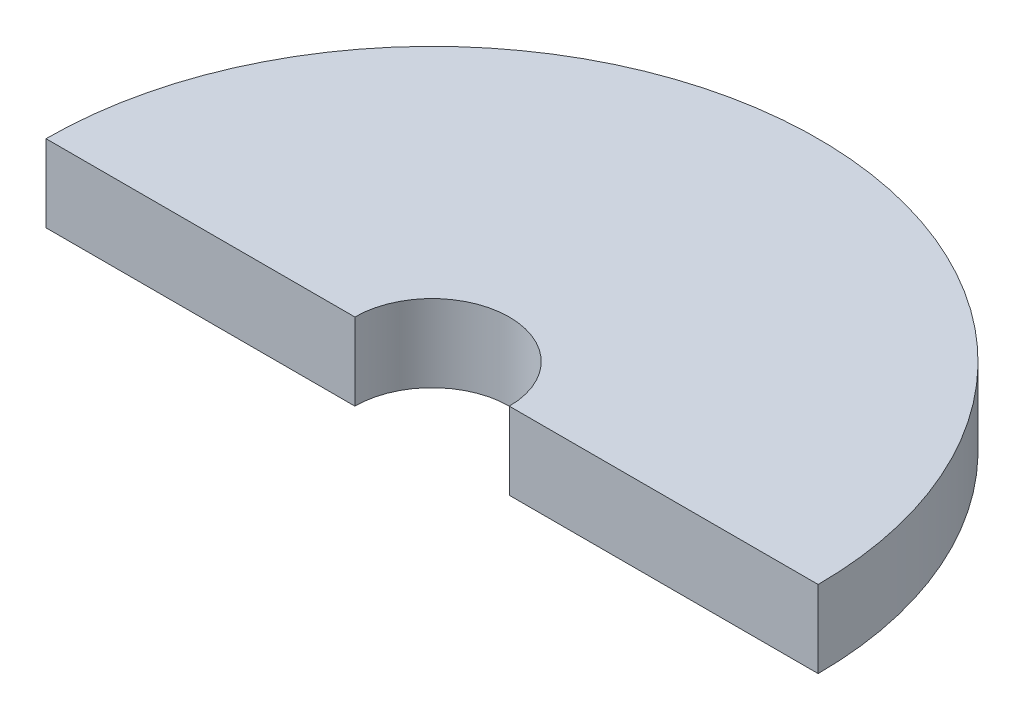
from build123d import *

# Parameters (mm, degrees)
ESQUISSE1_R      = 5
ESQUISSE1_R_2    = 1
EXTRUSION1_DEPTH = 1
ESQUISSE2_W      = 5
ESQUISSE2_H      = 1
COUPE_ANGLE      = 180


with BuildPart() as part:
    # Esquisse1 → Extrusion1 (new body)
    with BuildSketch(Plane(origin=(0, 0, 0), x_dir=(1, 0, 0), z_dir=(0, 1, 0))):
        Circle(ESQUISSE1_R)
        Circle(ESQUISSE1_R_2, mode=Mode.SUBTRACT)
    extrude(amount=EXTRUSION1_DEPTH)

    # Esquisse2 → Coupe (revolve, cut)
    with BuildSketch(Plane.XY):
        with Locations((2.5, 0.5)):
            Rectangle(ESQUISSE2_W, ESQUISSE2_H)
    revolve(axis=Axis((0, 4.670837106, 0), (0, -1, 0)), revolution_arc=COUPE_ANGLE, mode=Mode.SUBTRACT)


solid = part.part
